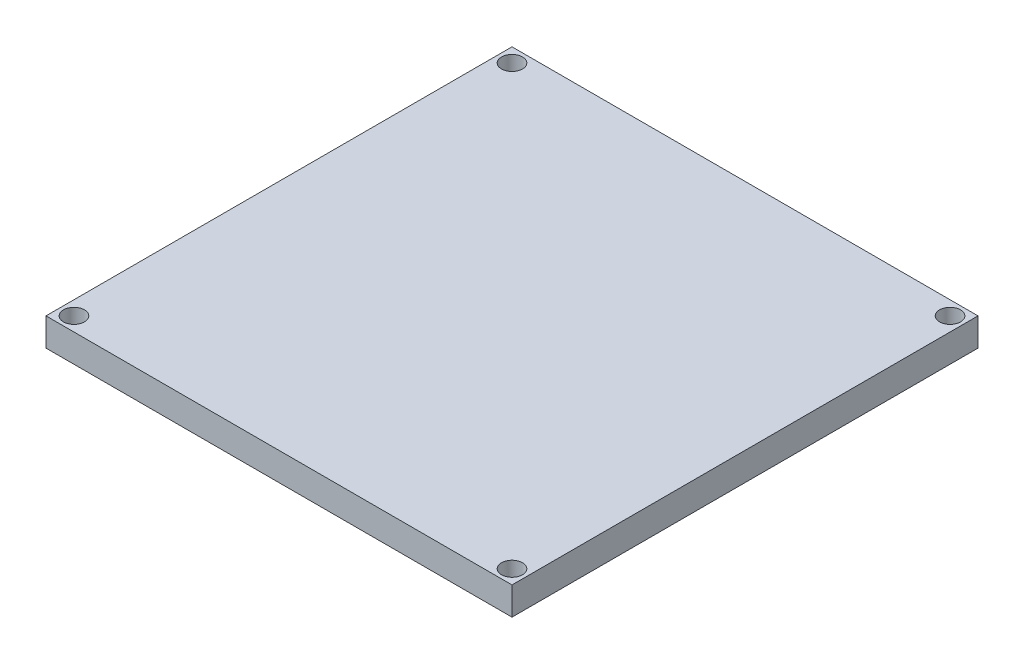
ISO-10303-21;
HEADER;
FILE_DESCRIPTION(('STEP AP214'),'2;1');
FILE_NAME('part.step','',(''),(''),'','','');
FILE_SCHEMA(('AUTOMOTIVE_DESIGN { 1 0 10303 214 1 1 1 1 }'));
ENDSEC;
DATA;
#1=APPLICATION_CONTEXT('core data for automotive mechanical design processes');
#2=APPLICATION_PROTOCOL_DEFINITION('international standard','automotive_design',2000,#1);
#3=PRODUCT_CONTEXT('',#1,'mechanical');
#4=PRODUCT('Part','Part','',(#3));
#5=PRODUCT_RELATED_PRODUCT_CATEGORY('part','',(#4));
#6=PRODUCT_DEFINITION_FORMATION('','',#4);
#7=PRODUCT_DEFINITION_CONTEXT('part definition',#1,'design');
#8=PRODUCT_DEFINITION('design','',#6,#7);
#9=PRODUCT_DEFINITION_SHAPE('','',#8);
#10=(LENGTH_UNIT() NAMED_UNIT(*) SI_UNIT(.MILLI.,.METRE.));
#11=(NAMED_UNIT(*) PLANE_ANGLE_UNIT() SI_UNIT($,.RADIAN.));
#12=(NAMED_UNIT(*) SI_UNIT($,.STERADIAN.) SOLID_ANGLE_UNIT());
#13=UNCERTAINTY_MEASURE_WITH_UNIT(LENGTH_MEASURE(1.E-05),#10,'distance_accuracy_value','');
#14=(GEOMETRIC_REPRESENTATION_CONTEXT(3) GLOBAL_UNCERTAINTY_ASSIGNED_CONTEXT((#13)) GLOBAL_UNIT_ASSIGNED_CONTEXT((#10,
#11,#12)) REPRESENTATION_CONTEXT('',''));
#15=CARTESIAN_POINT('',(0.,0.,0.));
#16=DIRECTION('',(0.,0.,1.));
#17=DIRECTION('',(1.,0.,0.));
#18=AXIS2_PLACEMENT_3D('',#15,#16,#17);
#19=CARTESIAN_POINT('',(50.,6.,50.));
#20=DIRECTION('',(-1.,0.,0.));
#21=DIRECTION('',(0.,0.,1.));
#22=AXIS2_PLACEMENT_3D('',#19,#20,#21);
#23=PLANE('',#22);
#24=DIRECTION('',(0.,0.,-1.));
#25=VECTOR('',#24,1.);
#26=CARTESIAN_POINT('',(50.,0.,50.));
#27=LINE('',#26,#25);
#28=CARTESIAN_POINT('',(50.,0.,50.));
#29=VERTEX_POINT('',#28);
#30=CARTESIAN_POINT('',(50.,0.,-50.));
#31=VERTEX_POINT('',#30);
#32=EDGE_CURVE('E113',#29,#31,#27,.T.);
#33=ORIENTED_EDGE('',*,*,#32,.T.);
#34=DIRECTION('',(0.,-1.,0.));
#35=VECTOR('',#34,1.);
#36=CARTESIAN_POINT('',(50.,6.,-50.));
#37=LINE('',#36,#35);
#38=CARTESIAN_POINT('',(50.,6.,-50.));
#39=VERTEX_POINT('',#38);
#40=EDGE_CURVE('E11',#39,#31,#37,.T.);
#41=ORIENTED_EDGE('',*,*,#40,.F.);
#42=DIRECTION('',(0.,0.,-1.));
#43=VECTOR('',#42,1.);
#44=CARTESIAN_POINT('',(50.,6.,50.));
#45=LINE('',#44,#43);
#46=CARTESIAN_POINT('',(50.,6.,50.));
#47=VERTEX_POINT('',#46);
#48=EDGE_CURVE('E97',#47,#39,#45,.T.);
#49=ORIENTED_EDGE('',*,*,#48,.F.);
#50=DIRECTION('',(0.,-1.,0.));
#51=VECTOR('',#50,1.);
#52=CARTESIAN_POINT('',(50.,6.,50.));
#53=LINE('',#52,#51);
#54=EDGE_CURVE('E109',#47,#29,#53,.T.);
#55=ORIENTED_EDGE('',*,*,#54,.T.);
#56=EDGE_LOOP('',(#33,#41,#49,#55));
#57=FACE_BOUND('',#56,.T.);
#58=ADVANCED_FACE('F45',(#57),#23,.F.);
#59=CARTESIAN_POINT('',(-50.,6.,-50.));
#60=DIRECTION('',(0.,0.,1.));
#61=DIRECTION('',(1.,0.,0.));
#62=AXIS2_PLACEMENT_3D('',#59,#60,#61);
#63=PLANE('',#62);
#64=DIRECTION('',(-1.,0.,0.));
#65=VECTOR('',#64,1.);
#66=CARTESIAN_POINT('',(-50.,0.,-50.));
#67=LINE('',#66,#65);
#68=CARTESIAN_POINT('',(-50.,0.,-50.));
#69=VERTEX_POINT('',#68);
#70=EDGE_CURVE('E102',#31,#69,#67,.T.);
#71=ORIENTED_EDGE('',*,*,#70,.T.);
#72=DIRECTION('',(0.,-1.,0.));
#73=VECTOR('',#72,1.);
#74=CARTESIAN_POINT('',(-50.,6.,-50.));
#75=LINE('',#74,#73);
#76=CARTESIAN_POINT('',(-50.,6.,-50.));
#77=VERTEX_POINT('',#76);
#78=EDGE_CURVE('E54',#77,#69,#75,.T.);
#79=ORIENTED_EDGE('',*,*,#78,.F.);
#80=DIRECTION('',(-1.,0.,0.));
#81=VECTOR('',#80,1.);
#82=CARTESIAN_POINT('',(-50.,6.,-50.));
#83=LINE('',#82,#81);
#84=EDGE_CURVE('E92',#39,#77,#83,.T.);
#85=ORIENTED_EDGE('',*,*,#84,.F.);
#86=ORIENTED_EDGE('',*,*,#40,.T.);
#87=EDGE_LOOP('',(#71,#79,#85,#86));
#88=FACE_BOUND('',#87,.T.);
#89=ADVANCED_FACE('F101',(#88),#63,.F.);
#90=CARTESIAN_POINT('',(-50.,6.,50.));
#91=DIRECTION('',(1.,0.,0.));
#92=DIRECTION('',(0.,0.,-1.));
#93=AXIS2_PLACEMENT_3D('',#90,#91,#92);
#94=PLANE('',#93);
#95=DIRECTION('',(0.,0.,1.));
#96=VECTOR('',#95,1.);
#97=CARTESIAN_POINT('',(-50.,0.,50.));
#98=LINE('',#97,#96);
#99=CARTESIAN_POINT('',(-50.,0.,50.));
#100=VERTEX_POINT('',#99);
#101=EDGE_CURVE('E79',#69,#100,#98,.T.);
#102=ORIENTED_EDGE('',*,*,#101,.T.);
#103=DIRECTION('',(0.,-1.,0.));
#104=VECTOR('',#103,1.);
#105=CARTESIAN_POINT('',(-50.,6.,50.));
#106=LINE('',#105,#104);
#107=CARTESIAN_POINT('',(-50.,6.,50.));
#108=VERTEX_POINT('',#107);
#109=EDGE_CURVE('E104',#108,#100,#106,.T.);
#110=ORIENTED_EDGE('',*,*,#109,.F.);
#111=DIRECTION('',(0.,0.,1.));
#112=VECTOR('',#111,1.);
#113=CARTESIAN_POINT('',(-50.,6.,50.));
#114=LINE('',#113,#112);
#115=EDGE_CURVE('E95',#77,#108,#114,.T.);
#116=ORIENTED_EDGE('',*,*,#115,.F.);
#117=ORIENTED_EDGE('',*,*,#78,.T.);
#118=EDGE_LOOP('',(#102,#110,#116,#117));
#119=FACE_BOUND('',#118,.T.);
#120=ADVANCED_FACE('F105',(#119),#94,.F.);
#121=CARTESIAN_POINT('',(-50.,6.,50.));
#122=DIRECTION('',(0.,0.,-1.));
#123=DIRECTION('',(-1.,0.,0.));
#124=AXIS2_PLACEMENT_3D('',#121,#122,#123);
#125=PLANE('',#124);
#126=DIRECTION('',(1.,0.,0.));
#127=VECTOR('',#126,1.);
#128=CARTESIAN_POINT('',(-50.,0.,50.));
#129=LINE('',#128,#127);
#130=EDGE_CURVE('E85',#100,#29,#129,.T.);
#131=ORIENTED_EDGE('',*,*,#130,.T.);
#132=ORIENTED_EDGE('',*,*,#54,.F.);
#133=DIRECTION('',(1.,0.,0.));
#134=VECTOR('',#133,1.);
#135=CARTESIAN_POINT('',(-50.,6.,50.));
#136=LINE('',#135,#134);
#137=EDGE_CURVE('E62',#108,#47,#136,.T.);
#138=ORIENTED_EDGE('',*,*,#137,.F.);
#139=ORIENTED_EDGE('',*,*,#109,.T.);
#140=EDGE_LOOP('',(#131,#132,#138,#139));
#141=FACE_BOUND('',#140,.T.);
#142=ADVANCED_FACE('F127',(#141),#125,.F.);
#143=CARTESIAN_POINT('',(0.,6.,0.));
#144=DIRECTION('',(0.,-1.,0.));
#145=DIRECTION('',(0.,0.,-1.));
#146=AXIS2_PLACEMENT_3D('',#143,#144,#145);
#147=PLANE('',#146);
#148=CARTESIAN_POINT('',(-47.0000000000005,6.,46.9999999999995));
#149=DIRECTION('',(0.,1.,0.));
#150=DIRECTION('',(0.,0.,1.));
#151=AXIS2_PLACEMENT_3D('',#148,#149,#150);
#152=CIRCLE('',#151,2.25);
#153=CARTESIAN_POINT('',(-47.0000000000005,6.,49.2499999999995));
#154=VERTEX_POINT('',#153);
#155=EDGE_CURVE('E146',#154,#154,#152,.T.);
#156=ORIENTED_EDGE('',*,*,#155,.F.);
#157=EDGE_LOOP('',(#156));
#158=FACE_BOUND('',#157,.T.);
#159=CARTESIAN_POINT('',(46.9999999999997,6.,47.0000000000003));
#160=DIRECTION('',(0.,1.,0.));
#161=DIRECTION('',(0.,0.,1.));
#162=AXIS2_PLACEMENT_3D('',#159,#160,#161);
#163=CIRCLE('',#162,2.25000000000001);
#164=CARTESIAN_POINT('',(46.9999999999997,6.,49.2500000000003));
#165=VERTEX_POINT('',#164);
#166=EDGE_CURVE('E154',#165,#165,#163,.T.);
#167=ORIENTED_EDGE('',*,*,#166,.F.);
#168=EDGE_LOOP('',(#167));
#169=FACE_BOUND('',#168,.T.);
#170=CARTESIAN_POINT('',(47.0000000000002,6.,-46.9999999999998));
#171=DIRECTION('',(0.,1.,0.));
#172=DIRECTION('',(0.,0.,1.));
#173=AXIS2_PLACEMENT_3D('',#170,#171,#172);
#174=CIRCLE('',#173,2.25);
#175=CARTESIAN_POINT('',(47.0000000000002,6.,-44.7499999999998));
#176=VERTEX_POINT('',#175);
#177=EDGE_CURVE('E138',#176,#176,#174,.T.);
#178=ORIENTED_EDGE('',*,*,#177,.F.);
#179=EDGE_LOOP('',(#178));
#180=FACE_BOUND('',#179,.T.);
#181=CARTESIAN_POINT('',(-47.,6.,-47.));
#182=DIRECTION('',(0.,1.,0.));
#183=DIRECTION('',(0.,0.,1.));
#184=AXIS2_PLACEMENT_3D('',#181,#182,#183);
#185=CIRCLE('',#184,2.25);
#186=CARTESIAN_POINT('',(-47.,6.,-44.75));
#187=VERTEX_POINT('',#186);
#188=EDGE_CURVE('E134',#187,#187,#185,.T.);
#189=ORIENTED_EDGE('',*,*,#188,.F.);
#190=EDGE_LOOP('',(#189));
#191=FACE_BOUND('',#190,.T.);
#192=ORIENTED_EDGE('',*,*,#48,.T.);
#193=ORIENTED_EDGE('',*,*,#84,.T.);
#194=ORIENTED_EDGE('',*,*,#115,.T.);
#195=ORIENTED_EDGE('',*,*,#137,.T.);
#196=EDGE_LOOP('',(#192,#193,#194,#195));
#197=FACE_BOUND('',#196,.T.);
#198=ADVANCED_FACE('F93',(#158,#169,#180,#191,#197),#147,.F.);
#199=CARTESIAN_POINT('',(0.,0.,0.));
#200=DIRECTION('',(0.,-1.,0.));
#201=DIRECTION('',(0.,0.,-1.));
#202=AXIS2_PLACEMENT_3D('',#199,#200,#201);
#203=PLANE('',#202);
#204=CARTESIAN_POINT('',(-47.0000000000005,0.,46.9999999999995));
#205=DIRECTION('',(0.,1.,0.));
#206=DIRECTION('',(0.,0.,1.));
#207=AXIS2_PLACEMENT_3D('',#204,#205,#206);
#208=CIRCLE('',#207,2.25);
#209=CARTESIAN_POINT('',(-47.0000000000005,0.,49.2499999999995));
#210=VERTEX_POINT('',#209);
#211=EDGE_CURVE('E142',#210,#210,#208,.T.);
#212=ORIENTED_EDGE('',*,*,#211,.T.);
#213=EDGE_LOOP('',(#212));
#214=FACE_BOUND('',#213,.T.);
#215=CARTESIAN_POINT('',(46.9999999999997,0.,47.0000000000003));
#216=DIRECTION('',(0.,1.,0.));
#217=DIRECTION('',(0.,0.,1.));
#218=AXIS2_PLACEMENT_3D('',#215,#216,#217);
#219=CIRCLE('',#218,2.25000000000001);
#220=CARTESIAN_POINT('',(46.9999999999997,0.,49.2500000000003));
#221=VERTEX_POINT('',#220);
#222=EDGE_CURVE('E150',#221,#221,#219,.T.);
#223=ORIENTED_EDGE('',*,*,#222,.T.);
#224=EDGE_LOOP('',(#223));
#225=FACE_BOUND('',#224,.T.);
#226=CARTESIAN_POINT('',(47.0000000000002,0.,-46.9999999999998));
#227=DIRECTION('',(0.,1.,0.));
#228=DIRECTION('',(0.,0.,1.));
#229=AXIS2_PLACEMENT_3D('',#226,#227,#228);
#230=CIRCLE('',#229,2.25);
#231=CARTESIAN_POINT('',(47.0000000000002,0.,-44.7499999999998));
#232=VERTEX_POINT('',#231);
#233=EDGE_CURVE('E158',#232,#232,#230,.T.);
#234=ORIENTED_EDGE('',*,*,#233,.T.);
#235=EDGE_LOOP('',(#234));
#236=FACE_BOUND('',#235,.T.);
#237=CARTESIAN_POINT('',(-47.,0.,-47.));
#238=DIRECTION('',(0.,1.,0.));
#239=DIRECTION('',(0.,0.,1.));
#240=AXIS2_PLACEMENT_3D('',#237,#238,#239);
#241=CIRCLE('',#240,2.25);
#242=CARTESIAN_POINT('',(-47.,0.,-44.75));
#243=VERTEX_POINT('',#242);
#244=EDGE_CURVE('E117',#243,#243,#241,.T.);
#245=ORIENTED_EDGE('',*,*,#244,.T.);
#246=EDGE_LOOP('',(#245));
#247=FACE_BOUND('',#246,.T.);
#248=ORIENTED_EDGE('',*,*,#32,.F.);
#249=ORIENTED_EDGE('',*,*,#130,.F.);
#250=ORIENTED_EDGE('',*,*,#101,.F.);
#251=ORIENTED_EDGE('',*,*,#70,.F.);
#252=EDGE_LOOP('',(#248,#249,#250,#251));
#253=FACE_BOUND('',#252,.T.);
#254=ADVANCED_FACE('F130',(#214,#225,#236,#247,#253),#203,.T.);
#255=CARTESIAN_POINT('',(-47.,0.,-47.));
#256=DIRECTION('',(0.,1.,0.));
#257=DIRECTION('',(0.,0.,1.));
#258=AXIS2_PLACEMENT_3D('',#255,#256,#257);
#259=CYLINDRICAL_SURFACE('',#258,2.25);
#260=ORIENTED_EDGE('',*,*,#244,.F.);
#261=EDGE_LOOP('',(#260));
#262=FACE_BOUND('',#261,.T.);
#263=ORIENTED_EDGE('',*,*,#188,.T.);
#264=EDGE_LOOP('',(#263));
#265=FACE_BOUND('',#264,.T.);
#266=ADVANCED_FACE('F174',(#262,#265),#259,.F.);
#267=CARTESIAN_POINT('',(47.0000000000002,0.,-46.9999999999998));
#268=DIRECTION('',(0.,1.,0.));
#269=DIRECTION('',(0.,0.,1.));
#270=AXIS2_PLACEMENT_3D('',#267,#268,#269);
#271=CYLINDRICAL_SURFACE('',#270,2.25);
#272=ORIENTED_EDGE('',*,*,#233,.F.);
#273=EDGE_LOOP('',(#272));
#274=FACE_BOUND('',#273,.T.);
#275=ORIENTED_EDGE('',*,*,#177,.T.);
#276=EDGE_LOOP('',(#275));
#277=FACE_BOUND('',#276,.T.);
#278=ADVANCED_FACE('F166',(#274,#277),#271,.F.);
#279=CARTESIAN_POINT('',(46.9999999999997,0.,47.0000000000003));
#280=DIRECTION('',(0.,1.,0.));
#281=DIRECTION('',(0.,0.,1.));
#282=AXIS2_PLACEMENT_3D('',#279,#280,#281);
#283=CYLINDRICAL_SURFACE('',#282,2.25000000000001);
#284=ORIENTED_EDGE('',*,*,#222,.F.);
#285=EDGE_LOOP('',(#284));
#286=FACE_BOUND('',#285,.T.);
#287=ORIENTED_EDGE('',*,*,#166,.T.);
#288=EDGE_LOOP('',(#287));
#289=FACE_BOUND('',#288,.T.);
#290=ADVANCED_FACE('F182',(#286,#289),#283,.F.);
#291=CARTESIAN_POINT('',(-47.0000000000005,0.,46.9999999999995));
#292=DIRECTION('',(0.,1.,0.));
#293=DIRECTION('',(0.,0.,1.));
#294=AXIS2_PLACEMENT_3D('',#291,#292,#293);
#295=CYLINDRICAL_SURFACE('',#294,2.25);
#296=ORIENTED_EDGE('',*,*,#211,.F.);
#297=EDGE_LOOP('',(#296));
#298=FACE_BOUND('',#297,.T.);
#299=ORIENTED_EDGE('',*,*,#155,.T.);
#300=EDGE_LOOP('',(#299));
#301=FACE_BOUND('',#300,.T.);
#302=ADVANCED_FACE('F233',(#298,#301),#295,.F.);
#303=CLOSED_SHELL('',(#58,#89,#120,#142,#198,#254,#266,#278,#290,#302));
#304=MANIFOLD_SOLID_BREP('B2',#303);
#305=ADVANCED_BREP_SHAPE_REPRESENTATION('',(#18,#304),#14);
#306=SHAPE_DEFINITION_REPRESENTATION(#9,#305);
ENDSEC;
END-ISO-10303-21;
